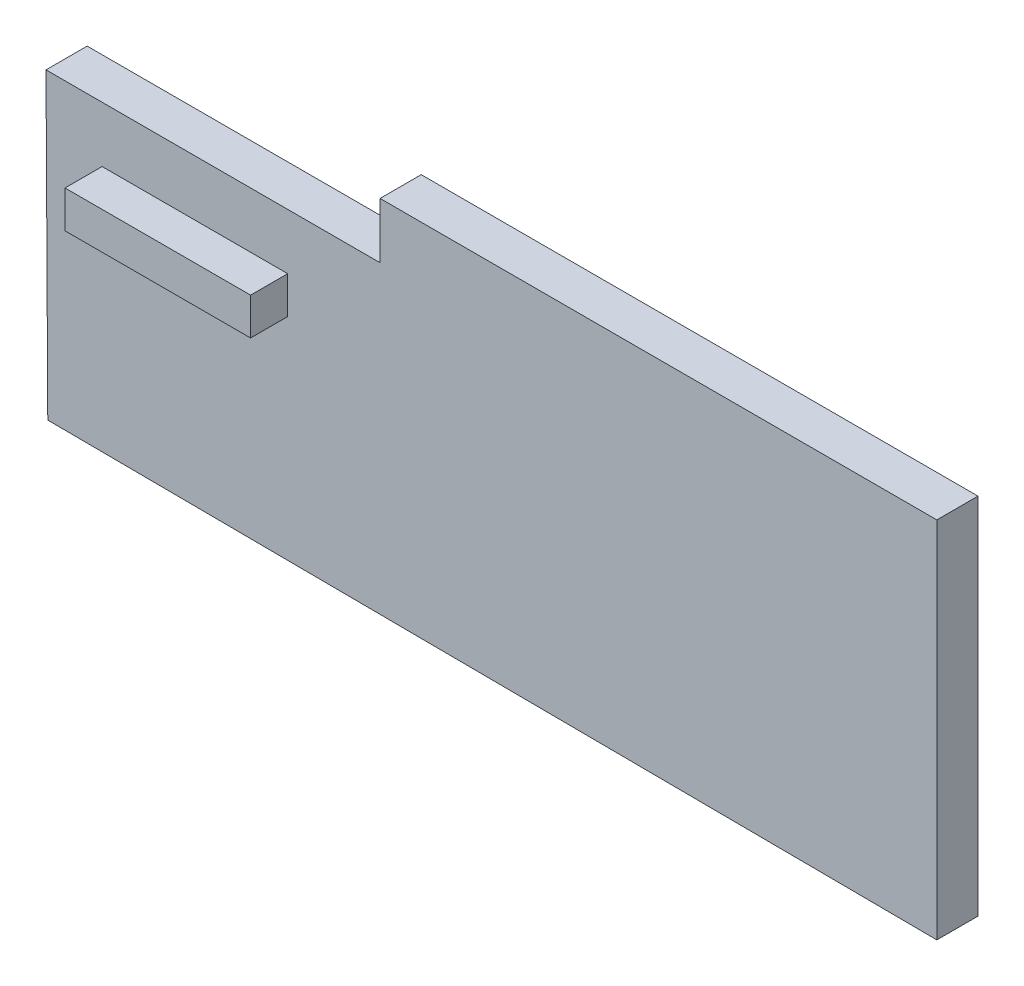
ISO-10303-21;
HEADER;
FILE_DESCRIPTION(('STEP AP214'),'2;1');
FILE_NAME('part.step','',(''),(''),'','','');
FILE_SCHEMA(('AUTOMOTIVE_DESIGN { 1 0 10303 214 1 1 1 1 }'));
ENDSEC;
DATA;
#1=APPLICATION_CONTEXT('core data for automotive mechanical design processes');
#2=APPLICATION_PROTOCOL_DEFINITION('international standard','automotive_design',2000,#1);
#3=PRODUCT_CONTEXT('',#1,'mechanical');
#4=PRODUCT('Part','Part','',(#3));
#5=PRODUCT_RELATED_PRODUCT_CATEGORY('part','',(#4));
#6=PRODUCT_DEFINITION_FORMATION('','',#4);
#7=PRODUCT_DEFINITION_CONTEXT('part definition',#1,'design');
#8=PRODUCT_DEFINITION('design','',#6,#7);
#9=PRODUCT_DEFINITION_SHAPE('','',#8);
#10=(LENGTH_UNIT() NAMED_UNIT(*) SI_UNIT(.MILLI.,.METRE.));
#11=(NAMED_UNIT(*) PLANE_ANGLE_UNIT() SI_UNIT($,.RADIAN.));
#12=(NAMED_UNIT(*) SI_UNIT($,.STERADIAN.) SOLID_ANGLE_UNIT());
#13=UNCERTAINTY_MEASURE_WITH_UNIT(LENGTH_MEASURE(1.E-05),#10,'distance_accuracy_value','');
#14=(GEOMETRIC_REPRESENTATION_CONTEXT(3) GLOBAL_UNCERTAINTY_ASSIGNED_CONTEXT((#13)) GLOBAL_UNIT_ASSIGNED_CONTEXT((#10,
#11,#12)) REPRESENTATION_CONTEXT('',''));
#15=CARTESIAN_POINT('',(0.,0.,0.));
#16=DIRECTION('',(0.,0.,1.));
#17=DIRECTION('',(1.,0.,0.));
#18=AXIS2_PLACEMENT_3D('',#15,#16,#17);
#19=CARTESIAN_POINT('',(0.,0.,1.1087838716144));
#20=DIRECTION('',(0.,0.,-1.));
#21=DIRECTION('',(-1.,0.,0.));
#22=AXIS2_PLACEMENT_3D('',#19,#20,#21);
#23=PLANE('',#22);
#24=DIRECTION('',(0.,1.,0.));
#25=VECTOR('',#24,1.);
#26=CARTESIAN_POINT('',(7.99999999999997,12.5,1.1087838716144));
#27=LINE('',#26,#25);
#28=CARTESIAN_POINT('',(7.99999999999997,2.7,1.1087838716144));
#29=VERTEX_POINT('',#28);
#30=CARTESIAN_POINT('',(7.99999999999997,12.5,1.1087838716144));
#31=VERTEX_POINT('',#30);
#32=EDGE_CURVE('E202',#29,#31,#27,.T.);
#33=ORIENTED_EDGE('',*,*,#32,.T.);
#34=DIRECTION('',(-1.,0.,0.));
#35=VECTOR('',#34,1.);
#36=CARTESIAN_POINT('',(7.99999999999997,12.5,1.1087838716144));
#37=LINE('',#36,#35);
#38=CARTESIAN_POINT('',(-7.00000000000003,12.5,1.1087838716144));
#39=VERTEX_POINT('',#38);
#40=EDGE_CURVE('E205',#31,#39,#37,.T.);
#41=ORIENTED_EDGE('',*,*,#40,.T.);
#42=DIRECTION('',(0.,-1.,0.));
#43=VECTOR('',#42,1.);
#44=CARTESIAN_POINT('',(-7.00000000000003,12.5,1.1087838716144));
#45=LINE('',#44,#43);
#46=CARTESIAN_POINT('',(-7.00000000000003,11.,1.1087838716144));
#47=VERTEX_POINT('',#46);
#48=EDGE_CURVE('E208',#39,#47,#45,.T.);
#49=ORIENTED_EDGE('',*,*,#48,.T.);
#50=DIRECTION('',(-1.,0.,0.));
#51=VECTOR('',#50,1.);
#52=CARTESIAN_POINT('',(-7.00000000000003,11.,1.1087838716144));
#53=LINE('',#52,#51);
#54=CARTESIAN_POINT('',(-16.,11.,1.1087838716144));
#55=VERTEX_POINT('',#54);
#56=EDGE_CURVE('E210',#47,#55,#53,.T.);
#57=ORIENTED_EDGE('',*,*,#56,.T.);
#58=DIRECTION('',(0.0058722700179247,-0.999982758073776,0.));
#59=VECTOR('',#58,1.);
#60=CARTESIAN_POINT('',(-15.9521521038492,2.85203149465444,1.1087838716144));
#61=LINE('',#60,#59);
#62=CARTESIAN_POINT('',(-15.9521521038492,2.85203149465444,1.1087838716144));
#63=VERTEX_POINT('',#62);
#64=EDGE_CURVE('E212',#55,#63,#61,.T.);
#65=ORIENTED_EDGE('',*,*,#64,.T.);
#66=DIRECTION('',(0.999979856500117,-0.00634717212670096,0.));
#67=VECTOR('',#66,1.);
#68=CARTESIAN_POINT('',(7.99999999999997,2.7,1.1087838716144));
#69=LINE('',#68,#67);
#70=EDGE_CURVE('E214',#63,#29,#69,.T.);
#71=ORIENTED_EDGE('',*,*,#70,.T.);
#72=EDGE_LOOP('',(#33,#41,#49,#57,#65,#71));
#73=FACE_BOUND('',#72,.T.);
#74=DIRECTION('',(1.,0.,0.));
#75=VECTOR('',#74,1.);
#76=CARTESIAN_POINT('',(-14.4881862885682,8.5,1.1087838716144));
#77=LINE('',#76,#75);
#78=CARTESIAN_POINT('',(-14.4881862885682,8.5,1.1087838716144));
#79=VERTEX_POINT('',#78);
#80=CARTESIAN_POINT('',(-9.48818628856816,8.5,1.1087838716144));
#81=VERTEX_POINT('',#80);
#82=EDGE_CURVE('E178',#79,#81,#77,.T.);
#83=ORIENTED_EDGE('',*,*,#82,.F.);
#84=DIRECTION('',(0.,-1.,0.));
#85=VECTOR('',#84,1.);
#86=CARTESIAN_POINT('',(-14.4881862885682,9.5,1.1087838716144));
#87=LINE('',#86,#85);
#88=CARTESIAN_POINT('',(-14.4881862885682,9.5,1.1087838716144));
#89=VERTEX_POINT('',#88);
#90=EDGE_CURVE('E187',#89,#79,#87,.T.);
#91=ORIENTED_EDGE('',*,*,#90,.F.);
#92=DIRECTION('',(-1.,0.,0.));
#93=VECTOR('',#92,1.);
#94=CARTESIAN_POINT('',(-14.4881862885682,9.5,1.1087838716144));
#95=LINE('',#94,#93);
#96=CARTESIAN_POINT('',(-9.48818628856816,9.5,1.1087838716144));
#97=VERTEX_POINT('',#96);
#98=EDGE_CURVE('E55',#97,#89,#95,.T.);
#99=ORIENTED_EDGE('',*,*,#98,.F.);
#100=DIRECTION('',(0.,1.,0.));
#101=VECTOR('',#100,1.);
#102=CARTESIAN_POINT('',(-9.48818628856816,9.5,1.1087838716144));
#103=LINE('',#102,#101);
#104=EDGE_CURVE('E50',#81,#97,#103,.T.);
#105=ORIENTED_EDGE('',*,*,#104,.F.);
#106=EDGE_LOOP('',(#83,#91,#99,#105));
#107=FACE_BOUND('',#106,.T.);
#108=ADVANCED_FACE('F35',(#73,#107),#23,.F.);
#109=CARTESIAN_POINT('',(7.99999999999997,12.5,1.1087838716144));
#110=DIRECTION('',(-1.,0.,0.));
#111=DIRECTION('',(0.,-1.,0.));
#112=AXIS2_PLACEMENT_3D('',#109,#110,#111);
#113=PLANE('',#112);
#114=DIRECTION('',(0.,1.,0.));
#115=VECTOR('',#114,1.);
#116=CARTESIAN_POINT('',(7.99999999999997,12.5,0.));
#117=LINE('',#116,#115);
#118=CARTESIAN_POINT('',(7.99999999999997,2.7,0.));
#119=VERTEX_POINT('',#118);
#120=CARTESIAN_POINT('',(7.99999999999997,12.5,0.));
#121=VERTEX_POINT('',#120);
#122=EDGE_CURVE('E201',#119,#121,#117,.T.);
#123=ORIENTED_EDGE('',*,*,#122,.T.);
#124=DIRECTION('',(0.,0.,-1.));
#125=VECTOR('',#124,1.);
#126=CARTESIAN_POINT('',(7.99999999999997,12.5,1.1087838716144));
#127=LINE('',#126,#125);
#128=EDGE_CURVE('E11',#31,#121,#127,.T.);
#129=ORIENTED_EDGE('',*,*,#128,.F.);
#130=ORIENTED_EDGE('',*,*,#32,.F.);
#131=DIRECTION('',(0.,0.,-1.));
#132=VECTOR('',#131,1.);
#133=CARTESIAN_POINT('',(7.99999999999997,2.7,1.1087838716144));
#134=LINE('',#133,#132);
#135=EDGE_CURVE('E216',#29,#119,#134,.T.);
#136=ORIENTED_EDGE('',*,*,#135,.T.);
#137=EDGE_LOOP('',(#123,#129,#130,#136));
#138=FACE_BOUND('',#137,.T.);
#139=ADVANCED_FACE('F37',(#138),#113,.F.);
#140=CARTESIAN_POINT('',(7.99999999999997,12.5,1.1087838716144));
#141=DIRECTION('',(0.,-1.,0.));
#142=DIRECTION('',(1.,0.,0.));
#143=AXIS2_PLACEMENT_3D('',#140,#141,#142);
#144=PLANE('',#143);
#145=DIRECTION('',(-1.,0.,0.));
#146=VECTOR('',#145,1.);
#147=CARTESIAN_POINT('',(7.99999999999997,12.5,0.));
#148=LINE('',#147,#146);
#149=CARTESIAN_POINT('',(-7.00000000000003,12.5,0.));
#150=VERTEX_POINT('',#149);
#151=EDGE_CURVE('E219',#121,#150,#148,.T.);
#152=ORIENTED_EDGE('',*,*,#151,.T.);
#153=DIRECTION('',(0.,0.,-1.));
#154=VECTOR('',#153,1.);
#155=CARTESIAN_POINT('',(-7.00000000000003,12.5,1.1087838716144));
#156=LINE('',#155,#154);
#157=EDGE_CURVE('E43',#39,#150,#156,.T.);
#158=ORIENTED_EDGE('',*,*,#157,.F.);
#159=ORIENTED_EDGE('',*,*,#40,.F.);
#160=ORIENTED_EDGE('',*,*,#128,.T.);
#161=EDGE_LOOP('',(#152,#158,#159,#160));
#162=FACE_BOUND('',#161,.T.);
#163=ADVANCED_FACE('F265',(#162),#144,.F.);
#164=CARTESIAN_POINT('',(-7.00000000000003,12.5,1.1087838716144));
#165=DIRECTION('',(1.,0.,0.));
#166=DIRECTION('',(0.,0.,-1.));
#167=AXIS2_PLACEMENT_3D('',#164,#165,#166);
#168=PLANE('',#167);
#169=DIRECTION('',(0.,-1.,0.));
#170=VECTOR('',#169,1.);
#171=CARTESIAN_POINT('',(-7.00000000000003,12.5,0.));
#172=LINE('',#171,#170);
#173=CARTESIAN_POINT('',(-7.00000000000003,11.,0.));
#174=VERTEX_POINT('',#173);
#175=EDGE_CURVE('E221',#150,#174,#172,.T.);
#176=ORIENTED_EDGE('',*,*,#175,.T.);
#177=DIRECTION('',(0.,0.,-1.));
#178=VECTOR('',#177,1.);
#179=CARTESIAN_POINT('',(-7.00000000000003,11.,1.1087838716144));
#180=LINE('',#179,#178);
#181=EDGE_CURVE('E236',#47,#174,#180,.T.);
#182=ORIENTED_EDGE('',*,*,#181,.F.);
#183=ORIENTED_EDGE('',*,*,#48,.F.);
#184=ORIENTED_EDGE('',*,*,#157,.T.);
#185=EDGE_LOOP('',(#176,#182,#183,#184));
#186=FACE_BOUND('',#185,.T.);
#187=ADVANCED_FACE('F243',(#186),#168,.F.);
#188=CARTESIAN_POINT('',(-7.00000000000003,11.,1.1087838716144));
#189=DIRECTION('',(0.,-1.,0.));
#190=DIRECTION('',(0.,0.,-1.));
#191=AXIS2_PLACEMENT_3D('',#188,#189,#190);
#192=PLANE('',#191);
#193=DIRECTION('',(-1.,0.,0.));
#194=VECTOR('',#193,1.);
#195=CARTESIAN_POINT('',(-7.00000000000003,11.,0.));
#196=LINE('',#195,#194);
#197=CARTESIAN_POINT('',(-16.,11.,0.));
#198=VERTEX_POINT('',#197);
#199=EDGE_CURVE('E223',#174,#198,#196,.T.);
#200=ORIENTED_EDGE('',*,*,#199,.T.);
#201=DIRECTION('',(0.,0.,-1.));
#202=VECTOR('',#201,1.);
#203=CARTESIAN_POINT('',(-16.,11.,1.1087838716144));
#204=LINE('',#203,#202);
#205=EDGE_CURVE('E233',#55,#198,#204,.T.);
#206=ORIENTED_EDGE('',*,*,#205,.F.);
#207=ORIENTED_EDGE('',*,*,#56,.F.);
#208=ORIENTED_EDGE('',*,*,#181,.T.);
#209=EDGE_LOOP('',(#200,#206,#207,#208));
#210=FACE_BOUND('',#209,.T.);
#211=ADVANCED_FACE('F254',(#210),#192,.F.);
#212=CARTESIAN_POINT('',(-15.9521521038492,2.85203149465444,1.1087838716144));
#213=DIRECTION('',(0.999982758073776,0.0058722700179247,0.));
#214=DIRECTION('',(-0.0058722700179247,0.999982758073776,0.));
#215=AXIS2_PLACEMENT_3D('',#212,#213,#214);
#216=PLANE('',#215);
#217=DIRECTION('',(0.0058722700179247,-0.999982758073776,0.));
#218=VECTOR('',#217,1.);
#219=CARTESIAN_POINT('',(-15.9521521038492,2.85203149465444,0.));
#220=LINE('',#219,#218);
#221=CARTESIAN_POINT('',(-15.9521521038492,2.85203149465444,0.));
#222=VERTEX_POINT('',#221);
#223=EDGE_CURVE('E225',#198,#222,#220,.T.);
#224=ORIENTED_EDGE('',*,*,#223,.T.);
#225=DIRECTION('',(0.,0.,-1.));
#226=VECTOR('',#225,1.);
#227=CARTESIAN_POINT('',(-15.9521521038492,2.85203149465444,1.1087838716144));
#228=LINE('',#227,#226);
#229=EDGE_CURVE('E230',#63,#222,#228,.T.);
#230=ORIENTED_EDGE('',*,*,#229,.F.);
#231=ORIENTED_EDGE('',*,*,#64,.F.);
#232=ORIENTED_EDGE('',*,*,#205,.T.);
#233=EDGE_LOOP('',(#224,#230,#231,#232));
#234=FACE_BOUND('',#233,.T.);
#235=ADVANCED_FACE('F258',(#234),#216,.F.);
#236=CARTESIAN_POINT('',(7.99999999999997,2.7,1.1087838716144));
#237=DIRECTION('',(0.00634717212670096,0.999979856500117,0.));
#238=DIRECTION('',(-0.999979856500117,0.00634717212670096,0.));
#239=AXIS2_PLACEMENT_3D('',#236,#237,#238);
#240=PLANE('',#239);
#241=DIRECTION('',(0.999979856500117,-0.00634717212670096,0.));
#242=VECTOR('',#241,1.);
#243=CARTESIAN_POINT('',(7.99999999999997,2.7,0.));
#244=LINE('',#243,#242);
#245=EDGE_CURVE('E206',#222,#119,#244,.T.);
#246=ORIENTED_EDGE('',*,*,#245,.T.);
#247=ORIENTED_EDGE('',*,*,#135,.F.);
#248=ORIENTED_EDGE('',*,*,#70,.F.);
#249=ORIENTED_EDGE('',*,*,#229,.T.);
#250=EDGE_LOOP('',(#246,#247,#248,#249));
#251=FACE_BOUND('',#250,.T.);
#252=ADVANCED_FACE('F268',(#251),#240,.F.);
#253=CARTESIAN_POINT('',(0.,0.,0.));
#254=DIRECTION('',(0.,0.,-1.));
#255=DIRECTION('',(-1.,0.,0.));
#256=AXIS2_PLACEMENT_3D('',#253,#254,#255);
#257=PLANE('',#256);
#258=ORIENTED_EDGE('',*,*,#122,.F.);
#259=ORIENTED_EDGE('',*,*,#245,.F.);
#260=ORIENTED_EDGE('',*,*,#223,.F.);
#261=ORIENTED_EDGE('',*,*,#199,.F.);
#262=ORIENTED_EDGE('',*,*,#175,.F.);
#263=ORIENTED_EDGE('',*,*,#151,.F.);
#264=EDGE_LOOP('',(#258,#259,#260,#261,#262,#263));
#265=FACE_BOUND('',#264,.T.);
#266=ADVANCED_FACE('F249',(#265),#257,.T.);
#267=CARTESIAN_POINT('',(-14.4881862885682,8.5,2.1087838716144));
#268=DIRECTION('',(0.,1.,0.));
#269=DIRECTION('',(0.,0.,1.));
#270=AXIS2_PLACEMENT_3D('',#267,#268,#269);
#271=PLANE('',#270);
#272=ORIENTED_EDGE('',*,*,#82,.T.);
#273=DIRECTION('',(0.,0.,-1.));
#274=VECTOR('',#273,1.);
#275=CARTESIAN_POINT('',(-9.48818628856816,8.5,2.1087838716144));
#276=LINE('',#275,#274);
#277=CARTESIAN_POINT('',(-9.48818628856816,8.5,2.1087838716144));
#278=VERTEX_POINT('',#277);
#279=EDGE_CURVE('E184',#278,#81,#276,.T.);
#280=ORIENTED_EDGE('',*,*,#279,.F.);
#281=DIRECTION('',(1.,0.,0.));
#282=VECTOR('',#281,1.);
#283=CARTESIAN_POINT('',(-14.4881862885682,8.5,2.1087838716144));
#284=LINE('',#283,#282);
#285=CARTESIAN_POINT('',(-14.4881862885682,8.5,2.1087838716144));
#286=VERTEX_POINT('',#285);
#287=EDGE_CURVE('E182',#286,#278,#284,.T.);
#288=ORIENTED_EDGE('',*,*,#287,.F.);
#289=DIRECTION('',(0.,0.,-1.));
#290=VECTOR('',#289,1.);
#291=CARTESIAN_POINT('',(-14.4881862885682,8.5,2.1087838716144));
#292=LINE('',#291,#290);
#293=EDGE_CURVE('E193',#286,#79,#292,.T.);
#294=ORIENTED_EDGE('',*,*,#293,.T.);
#295=EDGE_LOOP('',(#272,#280,#288,#294));
#296=FACE_BOUND('',#295,.T.);
#297=DIRECTION('',(1.,0.,0.));
#298=VECTOR('',#297,1.);
#299=CARTESIAN_POINT('',(-14.4881862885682,8.5,1.2587838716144));
#300=LINE('',#299,#298);
#301=CARTESIAN_POINT('',(-14.3381862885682,8.5,1.2587838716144));
#302=VERTEX_POINT('',#301);
#303=CARTESIAN_POINT('',(-9.63818628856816,8.5,1.2587838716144));
#304=VERTEX_POINT('',#303);
#305=EDGE_CURVE('E159',#302,#304,#300,.T.);
#306=ORIENTED_EDGE('',*,*,#305,.F.);
#307=DIRECTION('',(0.,0.,-1.));
#308=VECTOR('',#307,1.);
#309=CARTESIAN_POINT('',(-14.3381862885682,8.5,2.1087838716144));
#310=LINE('',#309,#308);
#311=CARTESIAN_POINT('',(-14.3381862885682,8.5,1.9587838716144));
#312=VERTEX_POINT('',#311);
#313=EDGE_CURVE('E154',#312,#302,#310,.T.);
#314=ORIENTED_EDGE('',*,*,#313,.F.);
#315=DIRECTION('',(1.,0.,0.));
#316=VECTOR('',#315,1.);
#317=CARTESIAN_POINT('',(-14.4881862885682,8.5,1.9587838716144));
#318=LINE('',#317,#316);
#319=CARTESIAN_POINT('',(-9.63818628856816,8.5,1.9587838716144));
#320=VERTEX_POINT('',#319);
#321=EDGE_CURVE('E167',#312,#320,#318,.T.);
#322=ORIENTED_EDGE('',*,*,#321,.T.);
#323=DIRECTION('',(0.,0.,-1.));
#324=VECTOR('',#323,1.);
#325=CARTESIAN_POINT('',(-9.63818628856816,8.5,2.1087838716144));
#326=LINE('',#325,#324);
#327=EDGE_CURVE('E168',#320,#304,#326,.T.);
#328=ORIENTED_EDGE('',*,*,#327,.T.);
#329=EDGE_LOOP('',(#306,#314,#322,#328));
#330=FACE_BOUND('',#329,.T.);
#331=ADVANCED_FACE('F275',(#296,#330),#271,.F.);
#332=CARTESIAN_POINT('',(-9.48818628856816,9.5,2.1087838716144));
#333=DIRECTION('',(-1.,0.,0.));
#334=DIRECTION('',(0.,0.,1.));
#335=AXIS2_PLACEMENT_3D('',#332,#333,#334);
#336=PLANE('',#335);
#337=ORIENTED_EDGE('',*,*,#104,.T.);
#338=DIRECTION('',(0.,0.,-1.));
#339=VECTOR('',#338,1.);
#340=CARTESIAN_POINT('',(-9.48818628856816,9.5,2.1087838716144));
#341=LINE('',#340,#339);
#342=CARTESIAN_POINT('',(-9.48818628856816,9.5,2.1087838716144));
#343=VERTEX_POINT('',#342);
#344=EDGE_CURVE('E199',#343,#97,#341,.T.);
#345=ORIENTED_EDGE('',*,*,#344,.F.);
#346=DIRECTION('',(0.,1.,0.));
#347=VECTOR('',#346,1.);
#348=CARTESIAN_POINT('',(-9.48818628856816,9.5,2.1087838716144));
#349=LINE('',#348,#347);
#350=EDGE_CURVE('E174',#278,#343,#349,.T.);
#351=ORIENTED_EDGE('',*,*,#350,.F.);
#352=ORIENTED_EDGE('',*,*,#279,.T.);
#353=EDGE_LOOP('',(#337,#345,#351,#352));
#354=FACE_BOUND('',#353,.T.);
#355=ADVANCED_FACE('F284',(#354),#336,.F.);
#356=CARTESIAN_POINT('',(-14.4881862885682,9.5,2.1087838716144));
#357=DIRECTION('',(0.,-1.,0.));
#358=DIRECTION('',(0.,0.,-1.));
#359=AXIS2_PLACEMENT_3D('',#356,#357,#358);
#360=PLANE('',#359);
#361=ORIENTED_EDGE('',*,*,#98,.T.);
#362=DIRECTION('',(0.,0.,-1.));
#363=VECTOR('',#362,1.);
#364=CARTESIAN_POINT('',(-14.4881862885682,9.5,2.1087838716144));
#365=LINE('',#364,#363);
#366=CARTESIAN_POINT('',(-14.4881862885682,9.5,2.1087838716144));
#367=VERTEX_POINT('',#366);
#368=EDGE_CURVE('E196',#367,#89,#365,.T.);
#369=ORIENTED_EDGE('',*,*,#368,.F.);
#370=DIRECTION('',(-1.,0.,0.));
#371=VECTOR('',#370,1.);
#372=CARTESIAN_POINT('',(-14.4881862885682,9.5,2.1087838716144));
#373=LINE('',#372,#371);
#374=EDGE_CURVE('E177',#343,#367,#373,.T.);
#375=ORIENTED_EDGE('',*,*,#374,.F.);
#376=ORIENTED_EDGE('',*,*,#344,.T.);
#377=EDGE_LOOP('',(#361,#369,#375,#376));
#378=FACE_BOUND('',#377,.T.);
#379=ADVANCED_FACE('F287',(#378),#360,.F.);
#380=CARTESIAN_POINT('',(-14.4881862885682,9.5,2.1087838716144));
#381=DIRECTION('',(1.,0.,0.));
#382=DIRECTION('',(0.,0.,-1.));
#383=AXIS2_PLACEMENT_3D('',#380,#381,#382);
#384=PLANE('',#383);
#385=ORIENTED_EDGE('',*,*,#90,.T.);
#386=ORIENTED_EDGE('',*,*,#293,.F.);
#387=DIRECTION('',(0.,-1.,0.));
#388=VECTOR('',#387,1.);
#389=CARTESIAN_POINT('',(-14.4881862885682,9.5,2.1087838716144));
#390=LINE('',#389,#388);
#391=EDGE_CURVE('E180',#367,#286,#390,.T.);
#392=ORIENTED_EDGE('',*,*,#391,.F.);
#393=ORIENTED_EDGE('',*,*,#368,.T.);
#394=EDGE_LOOP('',(#385,#386,#392,#393));
#395=FACE_BOUND('',#394,.T.);
#396=ADVANCED_FACE('F291',(#395),#384,.F.);
#397=CARTESIAN_POINT('',(0.,0.,2.1087838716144));
#398=DIRECTION('',(0.,0.,1.));
#399=DIRECTION('',(1.,0.,0.));
#400=AXIS2_PLACEMENT_3D('',#397,#398,#399);
#401=PLANE('',#400);
#402=ORIENTED_EDGE('',*,*,#350,.T.);
#403=ORIENTED_EDGE('',*,*,#374,.T.);
#404=ORIENTED_EDGE('',*,*,#391,.T.);
#405=ORIENTED_EDGE('',*,*,#287,.T.);
#406=EDGE_LOOP('',(#402,#403,#404,#405));
#407=FACE_BOUND('',#406,.T.);
#408=ADVANCED_FACE('F295',(#407),#401,.T.);
#409=CARTESIAN_POINT('',(-9.63818628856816,9.5,2.1087838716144));
#410=DIRECTION('',(-1.,0.,0.));
#411=DIRECTION('',(0.,0.,1.));
#412=AXIS2_PLACEMENT_3D('',#409,#410,#411);
#413=PLANE('',#412);
#414=DIRECTION('',(0.,1.,0.));
#415=VECTOR('',#414,1.);
#416=CARTESIAN_POINT('',(-9.63818628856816,9.5,1.2587838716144));
#417=LINE('',#416,#415);
#418=CARTESIAN_POINT('',(-9.63818628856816,9.35,1.2587838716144));
#419=VERTEX_POINT('',#418);
#420=EDGE_CURVE('E141',#304,#419,#417,.T.);
#421=ORIENTED_EDGE('',*,*,#420,.F.);
#422=ORIENTED_EDGE('',*,*,#327,.F.);
#423=DIRECTION('',(0.,1.,0.));
#424=VECTOR('',#423,1.);
#425=CARTESIAN_POINT('',(-9.63818628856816,9.5,1.9587838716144));
#426=LINE('',#425,#424);
#427=CARTESIAN_POINT('',(-9.63818628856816,9.35,1.9587838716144));
#428=VERTEX_POINT('',#427);
#429=EDGE_CURVE('E161',#320,#428,#426,.T.);
#430=ORIENTED_EDGE('',*,*,#429,.T.);
#431=DIRECTION('',(0.,0.,-1.));
#432=VECTOR('',#431,1.);
#433=CARTESIAN_POINT('',(-9.63818628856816,9.35,2.1087838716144));
#434=LINE('',#433,#432);
#435=EDGE_CURVE('E153',#428,#419,#434,.T.);
#436=ORIENTED_EDGE('',*,*,#435,.T.);
#437=EDGE_LOOP('',(#421,#422,#430,#436));
#438=FACE_BOUND('',#437,.T.);
#439=ADVANCED_FACE('F302',(#438),#413,.T.);
#440=CARTESIAN_POINT('',(-14.4881862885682,9.35,2.1087838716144));
#441=DIRECTION('',(0.,-1.,0.));
#442=DIRECTION('',(0.,0.,-1.));
#443=AXIS2_PLACEMENT_3D('',#440,#441,#442);
#444=PLANE('',#443);
#445=DIRECTION('',(-1.,0.,0.));
#446=VECTOR('',#445,1.);
#447=CARTESIAN_POINT('',(-14.4881862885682,9.35,1.2587838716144));
#448=LINE('',#447,#446);
#449=CARTESIAN_POINT('',(-14.3381862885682,9.35,1.2587838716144));
#450=VERTEX_POINT('',#449);
#451=EDGE_CURVE('E134',#419,#450,#448,.T.);
#452=ORIENTED_EDGE('',*,*,#451,.F.);
#453=ORIENTED_EDGE('',*,*,#435,.F.);
#454=DIRECTION('',(-1.,0.,0.));
#455=VECTOR('',#454,1.);
#456=CARTESIAN_POINT('',(-14.4881862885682,9.35,1.9587838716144));
#457=LINE('',#456,#455);
#458=CARTESIAN_POINT('',(-14.3381862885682,9.35,1.9587838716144));
#459=VERTEX_POINT('',#458);
#460=EDGE_CURVE('E149',#428,#459,#457,.T.);
#461=ORIENTED_EDGE('',*,*,#460,.T.);
#462=DIRECTION('',(0.,0.,-1.));
#463=VECTOR('',#462,1.);
#464=CARTESIAN_POINT('',(-14.3381862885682,9.35,2.1087838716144));
#465=LINE('',#464,#463);
#466=EDGE_CURVE('E147',#459,#450,#465,.T.);
#467=ORIENTED_EDGE('',*,*,#466,.T.);
#468=EDGE_LOOP('',(#452,#453,#461,#467));
#469=FACE_BOUND('',#468,.T.);
#470=ADVANCED_FACE('F148',(#469),#444,.T.);
#471=CARTESIAN_POINT('',(-14.3381862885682,9.5,2.1087838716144));
#472=DIRECTION('',(1.,0.,0.));
#473=DIRECTION('',(0.,0.,-1.));
#474=AXIS2_PLACEMENT_3D('',#471,#472,#473);
#475=PLANE('',#474);
#476=DIRECTION('',(0.,-1.,0.));
#477=VECTOR('',#476,1.);
#478=CARTESIAN_POINT('',(-14.3381862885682,9.5,1.2587838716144));
#479=LINE('',#478,#477);
#480=EDGE_CURVE('E138',#450,#302,#479,.T.);
#481=ORIENTED_EDGE('',*,*,#480,.F.);
#482=ORIENTED_EDGE('',*,*,#466,.F.);
#483=DIRECTION('',(0.,-1.,0.));
#484=VECTOR('',#483,1.);
#485=CARTESIAN_POINT('',(-14.3381862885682,9.5,1.9587838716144));
#486=LINE('',#485,#484);
#487=EDGE_CURVE('E165',#459,#312,#486,.T.);
#488=ORIENTED_EDGE('',*,*,#487,.T.);
#489=ORIENTED_EDGE('',*,*,#313,.T.);
#490=EDGE_LOOP('',(#481,#482,#488,#489));
#491=FACE_BOUND('',#490,.T.);
#492=ADVANCED_FACE('F156',(#491),#475,.T.);
#493=CARTESIAN_POINT('',(0.,0.,1.9587838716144));
#494=DIRECTION('',(0.,0.,1.));
#495=DIRECTION('',(1.,0.,0.));
#496=AXIS2_PLACEMENT_3D('',#493,#494,#495);
#497=PLANE('',#496);
#498=ORIENTED_EDGE('',*,*,#429,.F.);
#499=ORIENTED_EDGE('',*,*,#321,.F.);
#500=ORIENTED_EDGE('',*,*,#487,.F.);
#501=ORIENTED_EDGE('',*,*,#460,.F.);
#502=EDGE_LOOP('',(#498,#499,#500,#501));
#503=FACE_BOUND('',#502,.T.);
#504=ADVANCED_FACE('F306',(#503),#497,.F.);
#505=CARTESIAN_POINT('',(0.,0.,1.2587838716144));
#506=DIRECTION('',(0.,0.,1.));
#507=DIRECTION('',(1.,0.,0.));
#508=AXIS2_PLACEMENT_3D('',#505,#506,#507);
#509=PLANE('',#508);
#510=ORIENTED_EDGE('',*,*,#420,.T.);
#511=ORIENTED_EDGE('',*,*,#451,.T.);
#512=ORIENTED_EDGE('',*,*,#480,.T.);
#513=ORIENTED_EDGE('',*,*,#305,.T.);
#514=EDGE_LOOP('',(#510,#511,#512,#513));
#515=FACE_BOUND('',#514,.T.);
#516=ADVANCED_FACE('F136',(#515),#509,.T.);
#517=CLOSED_SHELL('',(#108,#139,#163,#187,#211,#235,#252,#266,#331,#355,#379,#396,#408,#439,
#470,#492,#504,#516));
#518=MANIFOLD_SOLID_BREP('B2',#517);
#519=ADVANCED_BREP_SHAPE_REPRESENTATION('',(#18,#518),#14);
#520=SHAPE_DEFINITION_REPRESENTATION(#9,#519);
ENDSEC;
END-ISO-10303-21;
